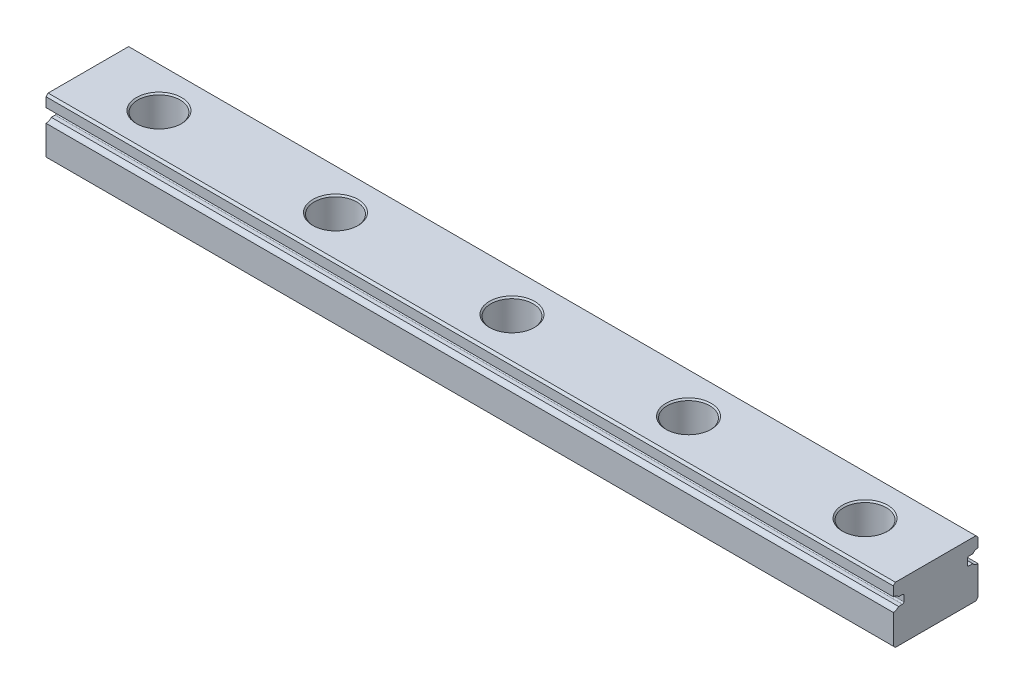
ISO-10303-21;
HEADER;
FILE_DESCRIPTION(('STEP AP214'),'2;1');
FILE_NAME('part.step','',(''),(''),'','','');
FILE_SCHEMA(('AUTOMOTIVE_DESIGN { 1 0 10303 214 1 1 1 1 }'));
ENDSEC;
DATA;
#1=APPLICATION_CONTEXT('core data for automotive mechanical design processes');
#2=APPLICATION_PROTOCOL_DEFINITION('international standard','automotive_design',2000,#1);
#3=PRODUCT_CONTEXT('',#1,'mechanical');
#4=PRODUCT('Part','Part','',(#3));
#5=PRODUCT_RELATED_PRODUCT_CATEGORY('part','',(#4));
#6=PRODUCT_DEFINITION_FORMATION('','',#4);
#7=PRODUCT_DEFINITION_CONTEXT('part definition',#1,'design');
#8=PRODUCT_DEFINITION('design','',#6,#7);
#9=PRODUCT_DEFINITION_SHAPE('','',#8);
#10=(LENGTH_UNIT() NAMED_UNIT(*) SI_UNIT(.MILLI.,.METRE.));
#11=(NAMED_UNIT(*) PLANE_ANGLE_UNIT() SI_UNIT($,.RADIAN.));
#12=(NAMED_UNIT(*) SI_UNIT($,.STERADIAN.) SOLID_ANGLE_UNIT());
#13=UNCERTAINTY_MEASURE_WITH_UNIT(LENGTH_MEASURE(1.E-05),#10,'distance_accuracy_value','');
#14=(GEOMETRIC_REPRESENTATION_CONTEXT(3) GLOBAL_UNCERTAINTY_ASSIGNED_CONTEXT((#13)) GLOBAL_UNIT_ASSIGNED_CONTEXT((#10,
#11,#12)) REPRESENTATION_CONTEXT('',''));
#15=CARTESIAN_POINT('',(0.,0.,0.));
#16=DIRECTION('',(0.,0.,1.));
#17=DIRECTION('',(1.,0.,0.));
#18=AXIS2_PLACEMENT_3D('',#15,#16,#17);
#19=CARTESIAN_POINT('',(120.,8.,-5.7));
#20=DIRECTION('',(0.,-1.,0.));
#21=DIRECTION('',(0.,0.,-1.));
#22=AXIS2_PLACEMENT_3D('',#19,#20,#21);
#23=PLANE('',#22);
#24=DIRECTION('',(0.,0.,1.));
#25=VECTOR('',#24,1.);
#26=CARTESIAN_POINT('',(0.,8.,-5.7));
#27=LINE('',#26,#25);
#28=CARTESIAN_POINT('',(0.,8.,-5.7));
#29=VERTEX_POINT('',#28);
#30=CARTESIAN_POINT('',(0.,8.,5.7));
#31=VERTEX_POINT('',#30);
#32=EDGE_CURVE('E11',#29,#31,#27,.T.);
#33=ORIENTED_EDGE('',*,*,#32,.T.);
#34=DIRECTION('',(-1.,0.,0.));
#35=VECTOR('',#34,1.);
#36=CARTESIAN_POINT('',(120.,8.,5.7));
#37=LINE('',#36,#35);
#38=CARTESIAN_POINT('',(120.,8.,5.7));
#39=VERTEX_POINT('',#38);
#40=EDGE_CURVE('E42',#39,#31,#37,.T.);
#41=ORIENTED_EDGE('',*,*,#40,.F.);
#42=DIRECTION('',(0.,0.,1.));
#43=VECTOR('',#42,1.);
#44=CARTESIAN_POINT('',(120.,8.,-5.7));
#45=LINE('',#44,#43);
#46=CARTESIAN_POINT('',(120.,8.,-5.7));
#47=VERTEX_POINT('',#46);
#48=EDGE_CURVE('E585',#47,#39,#45,.T.);
#49=ORIENTED_EDGE('',*,*,#48,.F.);
#50=DIRECTION('',(-1.,0.,0.));
#51=VECTOR('',#50,1.);
#52=CARTESIAN_POINT('',(120.,8.,-5.7));
#53=LINE('',#52,#51);
#54=EDGE_CURVE('E28',#47,#29,#53,.T.);
#55=ORIENTED_EDGE('',*,*,#54,.T.);
#56=EDGE_LOOP('',(#33,#41,#49,#55));
#57=FACE_BOUND('',#56,.T.);
#58=CARTESIAN_POINT('',(10.,8.,0.));
#59=DIRECTION('',(0.,-1.,0.));
#60=DIRECTION('',(0.,0.,-1.));
#61=AXIS2_PLACEMENT_3D('',#58,#59,#60);
#62=CIRCLE('',#61,3.205);
#63=CARTESIAN_POINT('',(10.,8.,-3.205));
#64=VERTEX_POINT('',#63);
#65=EDGE_CURVE('E402',#64,#64,#62,.T.);
#66=ORIENTED_EDGE('',*,*,#65,.T.);
#67=EDGE_LOOP('',(#66));
#68=FACE_BOUND('',#67,.T.);
#69=CARTESIAN_POINT('',(60.,8.,0.));
#70=DIRECTION('',(0.,-1.,0.));
#71=DIRECTION('',(0.,0.,-1.));
#72=AXIS2_PLACEMENT_3D('',#69,#70,#71);
#73=CIRCLE('',#72,3.205);
#74=CARTESIAN_POINT('',(60.,8.,-3.205));
#75=VERTEX_POINT('',#74);
#76=EDGE_CURVE('E451',#75,#75,#73,.T.);
#77=ORIENTED_EDGE('',*,*,#76,.T.);
#78=EDGE_LOOP('',(#77));
#79=FACE_BOUND('',#78,.T.);
#80=CARTESIAN_POINT('',(85.,8.,0.));
#81=DIRECTION('',(0.,-1.,0.));
#82=DIRECTION('',(0.,0.,-1.));
#83=AXIS2_PLACEMENT_3D('',#80,#81,#82);
#84=CIRCLE('',#83,3.205);
#85=CARTESIAN_POINT('',(85.,8.,-3.205));
#86=VERTEX_POINT('',#85);
#87=EDGE_CURVE('E447',#86,#86,#84,.T.);
#88=ORIENTED_EDGE('',*,*,#87,.T.);
#89=EDGE_LOOP('',(#88));
#90=FACE_BOUND('',#89,.T.);
#91=CARTESIAN_POINT('',(110.,8.,0.));
#92=DIRECTION('',(0.,-1.,0.));
#93=DIRECTION('',(0.,0.,-1.));
#94=AXIS2_PLACEMENT_3D('',#91,#92,#93);
#95=CIRCLE('',#94,3.205);
#96=CARTESIAN_POINT('',(110.,8.,-3.205));
#97=VERTEX_POINT('',#96);
#98=EDGE_CURVE('E435',#97,#97,#95,.T.);
#99=ORIENTED_EDGE('',*,*,#98,.T.);
#100=EDGE_LOOP('',(#99));
#101=FACE_BOUND('',#100,.T.);
#102=CARTESIAN_POINT('',(35.,8.,0.));
#103=DIRECTION('',(0.,-1.,0.));
#104=DIRECTION('',(0.,0.,-1.));
#105=AXIS2_PLACEMENT_3D('',#102,#103,#104);
#106=CIRCLE('',#105,3.205);
#107=CARTESIAN_POINT('',(35.,8.,-3.205));
#108=VERTEX_POINT('',#107);
#109=EDGE_CURVE('E431',#108,#108,#106,.T.);
#110=ORIENTED_EDGE('',*,*,#109,.T.);
#111=EDGE_LOOP('',(#110));
#112=FACE_BOUND('',#111,.T.);
#113=ADVANCED_FACE('F17',(#57,#68,#79,#90,#101,#112),#23,.F.);
#114=CARTESIAN_POINT('',(120.,5.4,6.));
#115=DIRECTION('',(1.,0.,0.));
#116=DIRECTION('',(0.,1.,0.));
#117=AXIS2_PLACEMENT_3D('',#114,#115,#116);
#118=PLANE('',#117);
#119=DIRECTION('',(0.,-0.707106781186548,0.707106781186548));
#120=VECTOR('',#119,1.);
#121=CARTESIAN_POINT('',(120.,8.,5.7));
#122=LINE('',#121,#120);
#123=CARTESIAN_POINT('',(120.,7.7,6.));
#124=VERTEX_POINT('',#123);
#125=EDGE_CURVE('E436',#39,#124,#122,.T.);
#126=ORIENTED_EDGE('',*,*,#125,.T.);
#127=DIRECTION('',(0.,-1.,0.));
#128=VECTOR('',#127,1.);
#129=CARTESIAN_POINT('',(120.,7.7,6.));
#130=LINE('',#129,#128);
#131=CARTESIAN_POINT('',(120.,6.36046863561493,6.));
#132=VERTEX_POINT('',#131);
#133=EDGE_CURVE('E554',#124,#132,#130,.T.);
#134=ORIENTED_EDGE('',*,*,#133,.T.);
#135=CARTESIAN_POINT('',(120.,5.4,6.));
#136=DIRECTION('',(1.,0.,0.));
#137=DIRECTION('',(0.,0.,-1.));
#138=AXIS2_PLACEMENT_3D('',#135,#136,#137);
#139=CIRCLE('',#138,0.9604686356);
#140=CARTESIAN_POINT('',(120.,6.,5.25));
#141=VERTEX_POINT('',#140);
#142=EDGE_CURVE('E708',#141,#132,#139,.T.);
#143=ORIENTED_EDGE('',*,*,#142,.F.);
#144=DIRECTION('',(0.,0.,-1.));
#145=VECTOR('',#144,1.);
#146=CARTESIAN_POINT('',(120.,6.,5.25));
#147=LINE('',#146,#145);
#148=CARTESIAN_POINT('',(120.,6.,4.7));
#149=VERTEX_POINT('',#148);
#150=EDGE_CURVE('E546',#141,#149,#147,.T.);
#151=ORIENTED_EDGE('',*,*,#150,.T.);
#152=CARTESIAN_POINT('',(120.,5.8,4.7));
#153=DIRECTION('',(1.,0.,0.));
#154=DIRECTION('',(0.,0.,-1.));
#155=AXIS2_PLACEMENT_3D('',#152,#153,#154);
#156=CIRCLE('',#155,0.2);
#157=CARTESIAN_POINT('',(120.,5.8,4.5));
#158=VERTEX_POINT('',#157);
#159=EDGE_CURVE('E493',#158,#149,#156,.T.);
#160=ORIENTED_EDGE('',*,*,#159,.F.);
#161=DIRECTION('',(0.,-1.,0.));
#162=VECTOR('',#161,1.);
#163=CARTESIAN_POINT('',(120.,5.8,4.5));
#164=LINE('',#163,#162);
#165=CARTESIAN_POINT('',(120.,5.,4.5));
#166=VERTEX_POINT('',#165);
#167=EDGE_CURVE('E543',#158,#166,#164,.T.);
#168=ORIENTED_EDGE('',*,*,#167,.T.);
#169=CARTESIAN_POINT('',(120.,5.,4.7));
#170=DIRECTION('',(1.,0.,0.));
#171=DIRECTION('',(0.,0.,-1.));
#172=AXIS2_PLACEMENT_3D('',#169,#170,#171);
#173=CIRCLE('',#172,0.2);
#174=CARTESIAN_POINT('',(120.,4.8,4.7));
#175=VERTEX_POINT('',#174);
#176=EDGE_CURVE('E539',#175,#166,#173,.T.);
#177=ORIENTED_EDGE('',*,*,#176,.F.);
#178=DIRECTION('',(0.,0.,1.));
#179=VECTOR('',#178,1.);
#180=CARTESIAN_POINT('',(120.,4.8,4.7));
#181=LINE('',#180,#179);
#182=CARTESIAN_POINT('',(120.,4.8,5.25));
#183=VERTEX_POINT('',#182);
#184=EDGE_CURVE('E531',#175,#183,#181,.T.);
#185=ORIENTED_EDGE('',*,*,#184,.T.);
#186=CARTESIAN_POINT('',(120.,5.4,6.));
#187=DIRECTION('',(1.,0.,0.));
#188=DIRECTION('',(0.,0.,-1.));
#189=AXIS2_PLACEMENT_3D('',#186,#187,#188);
#190=CIRCLE('',#189,0.9604686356);
#191=CARTESIAN_POINT('',(120.,4.43953136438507,6.));
#192=VERTEX_POINT('',#191);
#193=EDGE_CURVE('E408',#192,#183,#190,.T.);
#194=ORIENTED_EDGE('',*,*,#193,.F.);
#195=DIRECTION('',(0.,-1.,0.));
#196=VECTOR('',#195,1.);
#197=CARTESIAN_POINT('',(120.,4.43953136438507,6.));
#198=LINE('',#197,#196);
#199=CARTESIAN_POINT('',(120.,0.3,6.));
#200=VERTEX_POINT('',#199);
#201=EDGE_CURVE('E424',#192,#200,#198,.T.);
#202=ORIENTED_EDGE('',*,*,#201,.T.);
#203=DIRECTION('',(0.,-0.707106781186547,-0.707106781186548));
#204=VECTOR('',#203,1.);
#205=CARTESIAN_POINT('',(120.,0.3,6.));
#206=LINE('',#205,#204);
#207=CARTESIAN_POINT('',(120.,0.,5.7));
#208=VERTEX_POINT('',#207);
#209=EDGE_CURVE('E420',#200,#208,#206,.T.);
#210=ORIENTED_EDGE('',*,*,#209,.T.);
#211=DIRECTION('',(0.,0.,-1.));
#212=VECTOR('',#211,1.);
#213=CARTESIAN_POINT('',(120.,0.,5.7));
#214=LINE('',#213,#212);
#215=CARTESIAN_POINT('',(120.,0.,-5.7));
#216=VERTEX_POINT('',#215);
#217=EDGE_CURVE('E425',#208,#216,#214,.T.);
#218=ORIENTED_EDGE('',*,*,#217,.T.);
#219=DIRECTION('',(0.,0.707106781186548,-0.707106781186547));
#220=VECTOR('',#219,1.);
#221=CARTESIAN_POINT('',(120.,0.,-5.7));
#222=LINE('',#221,#220);
#223=CARTESIAN_POINT('',(120.,0.3,-6.));
#224=VERTEX_POINT('',#223);
#225=EDGE_CURVE('E500',#216,#224,#222,.T.);
#226=ORIENTED_EDGE('',*,*,#225,.T.);
#227=DIRECTION('',(0.,1.,0.));
#228=VECTOR('',#227,1.);
#229=CARTESIAN_POINT('',(120.,0.3,-6.));
#230=LINE('',#229,#228);
#231=CARTESIAN_POINT('',(120.,4.43953136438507,-6.));
#232=VERTEX_POINT('',#231);
#233=EDGE_CURVE('E464',#224,#232,#230,.T.);
#234=ORIENTED_EDGE('',*,*,#233,.T.);
#235=CARTESIAN_POINT('',(120.,5.4,-6.));
#236=DIRECTION('',(1.,0.,0.));
#237=DIRECTION('',(0.,0.,-1.));
#238=AXIS2_PLACEMENT_3D('',#235,#236,#237);
#239=CIRCLE('',#238,0.9604686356);
#240=CARTESIAN_POINT('',(120.,4.8,-5.25));
#241=VERTEX_POINT('',#240);
#242=EDGE_CURVE('E669',#241,#232,#239,.T.);
#243=ORIENTED_EDGE('',*,*,#242,.F.);
#244=DIRECTION('',(0.,0.,1.));
#245=VECTOR('',#244,1.);
#246=CARTESIAN_POINT('',(120.,4.8,-5.25));
#247=LINE('',#246,#245);
#248=CARTESIAN_POINT('',(120.,4.8,-4.7));
#249=VERTEX_POINT('',#248);
#250=EDGE_CURVE('E359',#241,#249,#247,.T.);
#251=ORIENTED_EDGE('',*,*,#250,.T.);
#252=CARTESIAN_POINT('',(120.,5.,-4.7));
#253=DIRECTION('',(1.,0.,0.));
#254=DIRECTION('',(0.,0.,-1.));
#255=AXIS2_PLACEMENT_3D('',#252,#253,#254);
#256=CIRCLE('',#255,0.2);
#257=CARTESIAN_POINT('',(120.,5.,-4.5));
#258=VERTEX_POINT('',#257);
#259=EDGE_CURVE('E351',#258,#249,#256,.T.);
#260=ORIENTED_EDGE('',*,*,#259,.F.);
#261=DIRECTION('',(0.,1.,0.));
#262=VECTOR('',#261,1.);
#263=CARTESIAN_POINT('',(120.,5.,-4.5));
#264=LINE('',#263,#262);
#265=CARTESIAN_POINT('',(120.,5.8,-4.5));
#266=VERTEX_POINT('',#265);
#267=EDGE_CURVE('E356',#258,#266,#264,.T.);
#268=ORIENTED_EDGE('',*,*,#267,.T.);
#269=CARTESIAN_POINT('',(120.,5.8,-4.7));
#270=DIRECTION('',(1.,0.,0.));
#271=DIRECTION('',(0.,0.,-1.));
#272=AXIS2_PLACEMENT_3D('',#269,#270,#271);
#273=CIRCLE('',#272,0.2);
#274=CARTESIAN_POINT('',(120.,6.,-4.7));
#275=VERTEX_POINT('',#274);
#276=EDGE_CURVE('E382',#275,#266,#273,.T.);
#277=ORIENTED_EDGE('',*,*,#276,.F.);
#278=DIRECTION('',(0.,0.,-1.));
#279=VECTOR('',#278,1.);
#280=CARTESIAN_POINT('',(120.,6.,-4.7));
#281=LINE('',#280,#279);
#282=CARTESIAN_POINT('',(120.,6.,-5.25));
#283=VERTEX_POINT('',#282);
#284=EDGE_CURVE('E375',#275,#283,#281,.T.);
#285=ORIENTED_EDGE('',*,*,#284,.T.);
#286=CARTESIAN_POINT('',(120.,5.4,-6.));
#287=DIRECTION('',(1.,0.,0.));
#288=DIRECTION('',(0.,0.,-1.));
#289=AXIS2_PLACEMENT_3D('',#286,#287,#288);
#290=CIRCLE('',#289,0.9604686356);
#291=CARTESIAN_POINT('',(120.,6.36046863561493,-6.));
#292=VERTEX_POINT('',#291);
#293=EDGE_CURVE('E881',#292,#283,#290,.T.);
#294=ORIENTED_EDGE('',*,*,#293,.F.);
#295=DIRECTION('',(0.,1.,0.));
#296=VECTOR('',#295,1.);
#297=CARTESIAN_POINT('',(120.,6.36046863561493,-6.));
#298=LINE('',#297,#296);
#299=CARTESIAN_POINT('',(120.,7.7,-6.));
#300=VERTEX_POINT('',#299);
#301=EDGE_CURVE('E527',#292,#300,#298,.T.);
#302=ORIENTED_EDGE('',*,*,#301,.T.);
#303=DIRECTION('',(0.,0.707106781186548,0.707106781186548));
#304=VECTOR('',#303,1.);
#305=CARTESIAN_POINT('',(120.,7.7,-6.));
#306=LINE('',#305,#304);
#307=EDGE_CURVE('E594',#300,#47,#306,.T.);
#308=ORIENTED_EDGE('',*,*,#307,.T.);
#309=ORIENTED_EDGE('',*,*,#48,.T.);
#310=EDGE_LOOP('',(#126,#134,#143,#151,#160,#168,#177,#185,#194,#202,#210,#218,#226,#234,#243,
#251,#260,#268,#277,#285,#294,#302,#308,#309));
#311=FACE_BOUND('',#310,.T.);
#312=ADVANCED_FACE('F354',(#311),#118,.T.);
#313=CARTESIAN_POINT('',(120.,7.7,-6.));
#314=DIRECTION('',(0.,-0.707106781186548,0.707106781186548));
#315=DIRECTION('',(-1.,0.,0.));
#316=AXIS2_PLACEMENT_3D('',#313,#314,#315);
#317=PLANE('',#316);
#318=DIRECTION('',(0.,0.707106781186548,0.707106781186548));
#319=VECTOR('',#318,1.);
#320=CARTESIAN_POINT('',(0.,7.7,-6.));
#321=LINE('',#320,#319);
#322=CARTESIAN_POINT('',(0.,7.7,-6.));
#323=VERTEX_POINT('',#322);
#324=EDGE_CURVE('E581',#323,#29,#321,.T.);
#325=ORIENTED_EDGE('',*,*,#324,.T.);
#326=ORIENTED_EDGE('',*,*,#54,.F.);
#327=ORIENTED_EDGE('',*,*,#307,.F.);
#328=DIRECTION('',(-1.,0.,0.));
#329=VECTOR('',#328,1.);
#330=CARTESIAN_POINT('',(120.,7.7,-6.));
#331=LINE('',#330,#329);
#332=EDGE_CURVE('E586',#300,#323,#331,.T.);
#333=ORIENTED_EDGE('',*,*,#332,.T.);
#334=EDGE_LOOP('',(#325,#326,#327,#333));
#335=FACE_BOUND('',#334,.T.);
#336=ADVANCED_FACE('F789',(#335),#317,.F.);
#337=CARTESIAN_POINT('',(120.,8.,5.7));
#338=DIRECTION('',(0.,-0.707106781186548,-0.707106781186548));
#339=DIRECTION('',(0.,-0.707106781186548,0.707106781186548));
#340=AXIS2_PLACEMENT_3D('',#337,#338,#339);
#341=PLANE('',#340);
#342=DIRECTION('',(0.,-0.707106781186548,0.707106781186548));
#343=VECTOR('',#342,1.);
#344=CARTESIAN_POINT('',(0.,8.,5.7));
#345=LINE('',#344,#343);
#346=CARTESIAN_POINT('',(0.,7.7,6.));
#347=VERTEX_POINT('',#346);
#348=EDGE_CURVE('E665',#31,#347,#345,.T.);
#349=ORIENTED_EDGE('',*,*,#348,.T.);
#350=DIRECTION('',(-1.,0.,0.));
#351=VECTOR('',#350,1.);
#352=CARTESIAN_POINT('',(120.,7.7,6.));
#353=LINE('',#352,#351);
#354=EDGE_CURVE('E215',#124,#347,#353,.T.);
#355=ORIENTED_EDGE('',*,*,#354,.F.);
#356=ORIENTED_EDGE('',*,*,#125,.F.);
#357=ORIENTED_EDGE('',*,*,#40,.T.);
#358=EDGE_LOOP('',(#349,#355,#356,#357));
#359=FACE_BOUND('',#358,.T.);
#360=ADVANCED_FACE('F899',(#359),#341,.F.);
#361=CARTESIAN_POINT('',(120.,7.7,6.));
#362=DIRECTION('',(0.,0.,-1.));
#363=DIRECTION('',(0.,-1.,0.));
#364=AXIS2_PLACEMENT_3D('',#361,#362,#363);
#365=PLANE('',#364);
#366=DIRECTION('',(0.,-1.,0.));
#367=VECTOR('',#366,1.);
#368=CARTESIAN_POINT('',(0.,7.7,6.));
#369=LINE('',#368,#367);
#370=CARTESIAN_POINT('',(0.,6.36046863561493,6.));
#371=VERTEX_POINT('',#370);
#372=EDGE_CURVE('E575',#347,#371,#369,.T.);
#373=ORIENTED_EDGE('',*,*,#372,.T.);
#374=DIRECTION('',(-1.,0.,0.));
#375=VECTOR('',#374,1.);
#376=CARTESIAN_POINT('',(120.,6.36046863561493,6.));
#377=LINE('',#376,#375);
#378=EDGE_CURVE('E222',#132,#371,#377,.T.);
#379=ORIENTED_EDGE('',*,*,#378,.F.);
#380=ORIENTED_EDGE('',*,*,#133,.F.);
#381=ORIENTED_EDGE('',*,*,#354,.T.);
#382=EDGE_LOOP('',(#373,#379,#380,#381));
#383=FACE_BOUND('',#382,.T.);
#384=ADVANCED_FACE('F868',(#383),#365,.F.);
#385=CARTESIAN_POINT('',(120.,5.4,6.));
#386=DIRECTION('',(1.,0.,0.));
#387=DIRECTION('',(0.,0.,1.));
#388=AXIS2_PLACEMENT_3D('',#385,#386,#387);
#389=CYLINDRICAL_SURFACE('',#388,0.9604686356);
#390=CARTESIAN_POINT('',(0.,5.4,6.));
#391=DIRECTION('',(1.,0.,0.));
#392=DIRECTION('',(0.,0.,-1.));
#393=AXIS2_PLACEMENT_3D('',#390,#391,#392);
#394=CIRCLE('',#393,0.9604686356);
#395=CARTESIAN_POINT('',(0.,6.,5.25));
#396=VERTEX_POINT('',#395);
#397=EDGE_CURVE('E230',#396,#371,#394,.T.);
#398=ORIENTED_EDGE('',*,*,#397,.F.);
#399=DIRECTION('',(-1.,0.,0.));
#400=VECTOR('',#399,1.);
#401=CARTESIAN_POINT('',(120.,6.,5.25));
#402=LINE('',#401,#400);
#403=EDGE_CURVE('E574',#141,#396,#402,.T.);
#404=ORIENTED_EDGE('',*,*,#403,.F.);
#405=ORIENTED_EDGE('',*,*,#142,.T.);
#406=ORIENTED_EDGE('',*,*,#378,.T.);
#407=EDGE_LOOP('',(#398,#404,#405,#406));
#408=FACE_BOUND('',#407,.T.);
#409=ADVANCED_FACE('F831',(#408),#389,.F.);
#410=CARTESIAN_POINT('',(120.,6.,5.25));
#411=DIRECTION('',(0.,1.,0.));
#412=DIRECTION('',(1.,0.,0.));
#413=AXIS2_PLACEMENT_3D('',#410,#411,#412);
#414=PLANE('',#413);
#415=DIRECTION('',(0.,0.,-1.));
#416=VECTOR('',#415,1.);
#417=CARTESIAN_POINT('',(0.,6.,5.25));
#418=LINE('',#417,#416);
#419=CARTESIAN_POINT('',(0.,6.,4.7));
#420=VERTEX_POINT('',#419);
#421=EDGE_CURVE('E570',#396,#420,#418,.T.);
#422=ORIENTED_EDGE('',*,*,#421,.T.);
#423=DIRECTION('',(-1.,0.,0.));
#424=VECTOR('',#423,1.);
#425=CARTESIAN_POINT('',(120.,6.,4.7));
#426=LINE('',#425,#424);
#427=EDGE_CURVE('E473',#149,#420,#426,.T.);
#428=ORIENTED_EDGE('',*,*,#427,.F.);
#429=ORIENTED_EDGE('',*,*,#150,.F.);
#430=ORIENTED_EDGE('',*,*,#403,.T.);
#431=EDGE_LOOP('',(#422,#428,#429,#430));
#432=FACE_BOUND('',#431,.T.);
#433=ADVANCED_FACE('F827',(#432),#414,.F.);
#434=CARTESIAN_POINT('',(120.,5.8,4.7));
#435=DIRECTION('',(1.,0.,0.));
#436=DIRECTION('',(0.,0.,1.));
#437=AXIS2_PLACEMENT_3D('',#434,#435,#436);
#438=CYLINDRICAL_SURFACE('',#437,0.2);
#439=CARTESIAN_POINT('',(0.,5.8,4.7));
#440=DIRECTION('',(1.,0.,0.));
#441=DIRECTION('',(0.,0.,-1.));
#442=AXIS2_PLACEMENT_3D('',#439,#440,#441);
#443=CIRCLE('',#442,0.2);
#444=CARTESIAN_POINT('',(0.,5.8,4.5));
#445=VERTEX_POINT('',#444);
#446=EDGE_CURVE('E477',#445,#420,#443,.T.);
#447=ORIENTED_EDGE('',*,*,#446,.F.);
#448=DIRECTION('',(-1.,0.,0.));
#449=VECTOR('',#448,1.);
#450=CARTESIAN_POINT('',(120.,5.8,4.5));
#451=LINE('',#450,#449);
#452=EDGE_CURVE('E474',#158,#445,#451,.T.);
#453=ORIENTED_EDGE('',*,*,#452,.F.);
#454=ORIENTED_EDGE('',*,*,#159,.T.);
#455=ORIENTED_EDGE('',*,*,#427,.T.);
#456=EDGE_LOOP('',(#447,#453,#454,#455));
#457=FACE_BOUND('',#456,.T.);
#458=ADVANCED_FACE('F830',(#457),#438,.F.);
#459=CARTESIAN_POINT('',(120.,5.8,4.5));
#460=DIRECTION('',(0.,0.,-1.));
#461=DIRECTION('',(0.,-1.,0.));
#462=AXIS2_PLACEMENT_3D('',#459,#460,#461);
#463=PLANE('',#462);
#464=DIRECTION('',(0.,-1.,0.));
#465=VECTOR('',#464,1.);
#466=CARTESIAN_POINT('',(0.,5.8,4.5));
#467=LINE('',#466,#465);
#468=CARTESIAN_POINT('',(0.,5.,4.5));
#469=VERTEX_POINT('',#468);
#470=EDGE_CURVE('E469',#445,#469,#467,.T.);
#471=ORIENTED_EDGE('',*,*,#470,.T.);
#472=DIRECTION('',(-1.,0.,0.));
#473=VECTOR('',#472,1.);
#474=CARTESIAN_POINT('',(120.,5.,4.5));
#475=LINE('',#474,#473);
#476=EDGE_CURVE('E619',#166,#469,#475,.T.);
#477=ORIENTED_EDGE('',*,*,#476,.F.);
#478=ORIENTED_EDGE('',*,*,#167,.F.);
#479=ORIENTED_EDGE('',*,*,#452,.T.);
#480=EDGE_LOOP('',(#471,#477,#478,#479));
#481=FACE_BOUND('',#480,.T.);
#482=ADVANCED_FACE('F849',(#481),#463,.F.);
#483=CARTESIAN_POINT('',(120.,5.,4.7));
#484=DIRECTION('',(1.,0.,0.));
#485=DIRECTION('',(0.,0.,1.));
#486=AXIS2_PLACEMENT_3D('',#483,#484,#485);
#487=CYLINDRICAL_SURFACE('',#486,0.2);
#488=CARTESIAN_POINT('',(0.,5.,4.7));
#489=DIRECTION('',(1.,0.,0.));
#490=DIRECTION('',(0.,0.,-1.));
#491=AXIS2_PLACEMENT_3D('',#488,#489,#490);
#492=CIRCLE('',#491,0.2);
#493=CARTESIAN_POINT('',(0.,4.8,4.7));
#494=VERTEX_POINT('',#493);
#495=EDGE_CURVE('E565',#494,#469,#492,.T.);
#496=ORIENTED_EDGE('',*,*,#495,.F.);
#497=DIRECTION('',(-1.,0.,0.));
#498=VECTOR('',#497,1.);
#499=CARTESIAN_POINT('',(120.,4.8,4.7));
#500=LINE('',#499,#498);
#501=EDGE_CURVE('E403',#175,#494,#500,.T.);
#502=ORIENTED_EDGE('',*,*,#501,.F.);
#503=ORIENTED_EDGE('',*,*,#176,.T.);
#504=ORIENTED_EDGE('',*,*,#476,.T.);
#505=EDGE_LOOP('',(#496,#502,#503,#504));
#506=FACE_BOUND('',#505,.T.);
#507=ADVANCED_FACE('F777',(#506),#487,.F.);
#508=CARTESIAN_POINT('',(120.,4.8,4.7));
#509=DIRECTION('',(0.,-1.,0.));
#510=DIRECTION('',(0.,0.,-1.));
#511=AXIS2_PLACEMENT_3D('',#508,#509,#510);
#512=PLANE('',#511);
#513=DIRECTION('',(0.,0.,1.));
#514=VECTOR('',#513,1.);
#515=CARTESIAN_POINT('',(0.,4.8,4.7));
#516=LINE('',#515,#514);
#517=CARTESIAN_POINT('',(0.,4.8,5.25));
#518=VERTEX_POINT('',#517);
#519=EDGE_CURVE('E407',#494,#518,#516,.T.);
#520=ORIENTED_EDGE('',*,*,#519,.T.);
#521=DIRECTION('',(-1.,0.,0.));
#522=VECTOR('',#521,1.);
#523=CARTESIAN_POINT('',(120.,4.8,5.25));
#524=LINE('',#523,#522);
#525=EDGE_CURVE('E416',#183,#518,#524,.T.);
#526=ORIENTED_EDGE('',*,*,#525,.F.);
#527=ORIENTED_EDGE('',*,*,#184,.F.);
#528=ORIENTED_EDGE('',*,*,#501,.T.);
#529=EDGE_LOOP('',(#520,#526,#527,#528));
#530=FACE_BOUND('',#529,.T.);
#531=ADVANCED_FACE('F768',(#530),#512,.F.);
#532=CARTESIAN_POINT('',(120.,5.4,6.));
#533=DIRECTION('',(1.,0.,0.));
#534=DIRECTION('',(0.,0.,1.));
#535=AXIS2_PLACEMENT_3D('',#532,#533,#534);
#536=CYLINDRICAL_SURFACE('',#535,0.9604686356);
#537=CARTESIAN_POINT('',(0.,5.4,6.));
#538=DIRECTION('',(1.,0.,0.));
#539=DIRECTION('',(0.,0.,-1.));
#540=AXIS2_PLACEMENT_3D('',#537,#538,#539);
#541=CIRCLE('',#540,0.9604686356);
#542=CARTESIAN_POINT('',(0.,4.43953136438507,6.));
#543=VERTEX_POINT('',#542);
#544=EDGE_CURVE('E569',#543,#518,#541,.T.);
#545=ORIENTED_EDGE('',*,*,#544,.F.);
#546=DIRECTION('',(-1.,0.,0.));
#547=VECTOR('',#546,1.);
#548=CARTESIAN_POINT('',(120.,4.43953136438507,6.));
#549=LINE('',#548,#547);
#550=EDGE_CURVE('E440',#192,#543,#549,.T.);
#551=ORIENTED_EDGE('',*,*,#550,.F.);
#552=ORIENTED_EDGE('',*,*,#193,.T.);
#553=ORIENTED_EDGE('',*,*,#525,.T.);
#554=EDGE_LOOP('',(#545,#551,#552,#553));
#555=FACE_BOUND('',#554,.T.);
#556=ADVANCED_FACE('F766',(#555),#536,.F.);
#557=CARTESIAN_POINT('',(120.,4.43953136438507,6.));
#558=DIRECTION('',(0.,0.,-1.));
#559=DIRECTION('',(0.,-1.,0.));
#560=AXIS2_PLACEMENT_3D('',#557,#558,#559);
#561=PLANE('',#560);
#562=DIRECTION('',(0.,-1.,0.));
#563=VECTOR('',#562,1.);
#564=CARTESIAN_POINT('',(0.,4.43953136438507,6.));
#565=LINE('',#564,#563);
#566=CARTESIAN_POINT('',(0.,0.3,6.));
#567=VERTEX_POINT('',#566);
#568=EDGE_CURVE('E419',#543,#567,#565,.T.);
#569=ORIENTED_EDGE('',*,*,#568,.T.);
#570=DIRECTION('',(-1.,0.,0.));
#571=VECTOR('',#570,1.);
#572=CARTESIAN_POINT('',(120.,0.3,6.));
#573=LINE('',#572,#571);
#574=EDGE_CURVE('E535',#200,#567,#573,.T.);
#575=ORIENTED_EDGE('',*,*,#574,.F.);
#576=ORIENTED_EDGE('',*,*,#201,.F.);
#577=ORIENTED_EDGE('',*,*,#550,.T.);
#578=EDGE_LOOP('',(#569,#575,#576,#577));
#579=FACE_BOUND('',#578,.T.);
#580=ADVANCED_FACE('F743',(#579),#561,.F.);
#581=CARTESIAN_POINT('',(120.,0.3,6.));
#582=DIRECTION('',(0.,0.707106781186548,-0.707106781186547));
#583=DIRECTION('',(-1.,0.,0.));
#584=AXIS2_PLACEMENT_3D('',#581,#582,#583);
#585=PLANE('',#584);
#586=DIRECTION('',(0.,-0.707106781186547,-0.707106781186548));
#587=VECTOR('',#586,1.);
#588=CARTESIAN_POINT('',(0.,0.3,6.));
#589=LINE('',#588,#587);
#590=CARTESIAN_POINT('',(0.,0.,5.7));
#591=VERTEX_POINT('',#590);
#592=EDGE_CURVE('E514',#567,#591,#589,.T.);
#593=ORIENTED_EDGE('',*,*,#592,.T.);
#594=DIRECTION('',(-1.,0.,0.));
#595=VECTOR('',#594,1.);
#596=CARTESIAN_POINT('',(120.,0.,5.7));
#597=LINE('',#596,#595);
#598=EDGE_CURVE('E457',#208,#591,#597,.T.);
#599=ORIENTED_EDGE('',*,*,#598,.F.);
#600=ORIENTED_EDGE('',*,*,#209,.F.);
#601=ORIENTED_EDGE('',*,*,#574,.T.);
#602=EDGE_LOOP('',(#593,#599,#600,#601));
#603=FACE_BOUND('',#602,.T.);
#604=ADVANCED_FACE('F739',(#603),#585,.F.);
#605=CARTESIAN_POINT('',(120.,0.,5.7));
#606=DIRECTION('',(0.,1.,0.));
#607=DIRECTION('',(1.,0.,0.));
#608=AXIS2_PLACEMENT_3D('',#605,#606,#607);
#609=PLANE('',#608);
#610=DIRECTION('',(0.,0.,-1.));
#611=VECTOR('',#610,1.);
#612=CARTESIAN_POINT('',(0.,0.,5.7));
#613=LINE('',#612,#611);
#614=CARTESIAN_POINT('',(0.,0.,-5.7));
#615=VERTEX_POINT('',#614);
#616=EDGE_CURVE('E460',#591,#615,#613,.T.);
#617=ORIENTED_EDGE('',*,*,#616,.T.);
#618=DIRECTION('',(-1.,0.,0.));
#619=VECTOR('',#618,1.);
#620=CARTESIAN_POINT('',(120.,0.,-5.7));
#621=LINE('',#620,#619);
#622=EDGE_CURVE('E611',#216,#615,#621,.T.);
#623=ORIENTED_EDGE('',*,*,#622,.F.);
#624=ORIENTED_EDGE('',*,*,#217,.F.);
#625=ORIENTED_EDGE('',*,*,#598,.T.);
#626=EDGE_LOOP('',(#617,#623,#624,#625));
#627=FACE_BOUND('',#626,.T.);
#628=CARTESIAN_POINT('',(10.,0.,0.));
#629=DIRECTION('',(0.,-1.,0.));
#630=DIRECTION('',(0.,0.,-1.));
#631=AXIS2_PLACEMENT_3D('',#628,#629,#630);
#632=CIRCLE('',#631,1.955);
#633=CARTESIAN_POINT('',(10.,0.,-1.955));
#634=VERTEX_POINT('',#633);
#635=EDGE_CURVE('E523',#634,#634,#632,.T.);
#636=ORIENTED_EDGE('',*,*,#635,.F.);
#637=EDGE_LOOP('',(#636));
#638=FACE_BOUND('',#637,.T.);
#639=CARTESIAN_POINT('',(60.,0.,0.));
#640=DIRECTION('',(0.,-1.,0.));
#641=DIRECTION('',(0.,0.,-1.));
#642=AXIS2_PLACEMENT_3D('',#639,#640,#641);
#643=CIRCLE('',#642,1.955);
#644=CARTESIAN_POINT('',(60.,0.,-1.955));
#645=VERTEX_POINT('',#644);
#646=EDGE_CURVE('E502',#645,#645,#643,.T.);
#647=ORIENTED_EDGE('',*,*,#646,.F.);
#648=EDGE_LOOP('',(#647));
#649=FACE_BOUND('',#648,.T.);
#650=CARTESIAN_POINT('',(85.,0.,0.));
#651=DIRECTION('',(0.,-1.,0.));
#652=DIRECTION('',(0.,0.,-1.));
#653=AXIS2_PLACEMENT_3D('',#650,#651,#652);
#654=CIRCLE('',#653,1.955);
#655=CARTESIAN_POINT('',(85.,0.,-1.955));
#656=VERTEX_POINT('',#655);
#657=EDGE_CURVE('E490',#656,#656,#654,.T.);
#658=ORIENTED_EDGE('',*,*,#657,.F.);
#659=EDGE_LOOP('',(#658));
#660=FACE_BOUND('',#659,.T.);
#661=CARTESIAN_POINT('',(110.,0.,0.));
#662=DIRECTION('',(0.,-1.,0.));
#663=DIRECTION('',(0.,0.,-1.));
#664=AXIS2_PLACEMENT_3D('',#661,#662,#663);
#665=CIRCLE('',#664,1.955);
#666=CARTESIAN_POINT('',(110.,0.,-1.955));
#667=VERTEX_POINT('',#666);
#668=EDGE_CURVE('E483',#667,#667,#665,.T.);
#669=ORIENTED_EDGE('',*,*,#668,.F.);
#670=EDGE_LOOP('',(#669));
#671=FACE_BOUND('',#670,.T.);
#672=CARTESIAN_POINT('',(35.,0.,0.));
#673=DIRECTION('',(0.,-1.,0.));
#674=DIRECTION('',(0.,0.,-1.));
#675=AXIS2_PLACEMENT_3D('',#672,#673,#674);
#676=CIRCLE('',#675,1.955);
#677=CARTESIAN_POINT('',(35.,0.,-1.955));
#678=VERTEX_POINT('',#677);
#679=EDGE_CURVE('E564',#678,#678,#676,.T.);
#680=ORIENTED_EDGE('',*,*,#679,.F.);
#681=EDGE_LOOP('',(#680));
#682=FACE_BOUND('',#681,.T.);
#683=ADVANCED_FACE('F735',(#627,#638,#649,#660,#671,#682),#609,.F.);
#684=CARTESIAN_POINT('',(120.,0.,-5.7));
#685=DIRECTION('',(0.,0.707106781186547,0.707106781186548));
#686=DIRECTION('',(1.,0.,0.));
#687=AXIS2_PLACEMENT_3D('',#684,#685,#686);
#688=PLANE('',#687);
#689=DIRECTION('',(0.,0.707106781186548,-0.707106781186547));
#690=VECTOR('',#689,1.);
#691=CARTESIAN_POINT('',(0.,0.,-5.7));
#692=LINE('',#691,#690);
#693=CARTESIAN_POINT('',(0.,0.3,-6.));
#694=VERTEX_POINT('',#693);
#695=EDGE_CURVE('E461',#615,#694,#692,.T.);
#696=ORIENTED_EDGE('',*,*,#695,.T.);
#697=DIRECTION('',(-1.,0.,0.));
#698=VECTOR('',#697,1.);
#699=CARTESIAN_POINT('',(120.,0.3,-6.));
#700=LINE('',#699,#698);
#701=EDGE_CURVE('E643',#224,#694,#700,.T.);
#702=ORIENTED_EDGE('',*,*,#701,.F.);
#703=ORIENTED_EDGE('',*,*,#225,.F.);
#704=ORIENTED_EDGE('',*,*,#622,.T.);
#705=EDGE_LOOP('',(#696,#702,#703,#704));
#706=FACE_BOUND('',#705,.T.);
#707=ADVANCED_FACE('F729',(#706),#688,.F.);
#708=CARTESIAN_POINT('',(120.,0.3,-6.));
#709=DIRECTION('',(0.,0.,1.));
#710=DIRECTION('',(1.,0.,0.));
#711=AXIS2_PLACEMENT_3D('',#708,#709,#710);
#712=PLANE('',#711);
#713=DIRECTION('',(0.,1.,0.));
#714=VECTOR('',#713,1.);
#715=CARTESIAN_POINT('',(0.,0.3,-6.));
#716=LINE('',#715,#714);
#717=CARTESIAN_POINT('',(0.,4.43953136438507,-6.));
#718=VERTEX_POINT('',#717);
#719=EDGE_CURVE('E613',#694,#718,#716,.T.);
#720=ORIENTED_EDGE('',*,*,#719,.T.);
#721=DIRECTION('',(-1.,0.,0.));
#722=VECTOR('',#721,1.);
#723=CARTESIAN_POINT('',(120.,4.43953136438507,-6.));
#724=LINE('',#723,#722);
#725=EDGE_CURVE('E393',#232,#718,#724,.T.);
#726=ORIENTED_EDGE('',*,*,#725,.F.);
#727=ORIENTED_EDGE('',*,*,#233,.F.);
#728=ORIENTED_EDGE('',*,*,#701,.T.);
#729=EDGE_LOOP('',(#720,#726,#727,#728));
#730=FACE_BOUND('',#729,.T.);
#731=ADVANCED_FACE('F726',(#730),#712,.F.);
#732=CARTESIAN_POINT('',(120.,5.4,-6.));
#733=DIRECTION('',(1.,0.,0.));
#734=DIRECTION('',(0.,0.,1.));
#735=AXIS2_PLACEMENT_3D('',#732,#733,#734);
#736=CYLINDRICAL_SURFACE('',#735,0.9604686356);
#737=CARTESIAN_POINT('',(0.,5.4,-6.));
#738=DIRECTION('',(1.,0.,0.));
#739=DIRECTION('',(0.,0.,-1.));
#740=AXIS2_PLACEMENT_3D('',#737,#738,#739);
#741=CIRCLE('',#740,0.9604686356);
#742=CARTESIAN_POINT('',(0.,4.8,-5.25));
#743=VERTEX_POINT('',#742);
#744=EDGE_CURVE('E415',#743,#718,#741,.T.);
#745=ORIENTED_EDGE('',*,*,#744,.F.);
#746=DIRECTION('',(-1.,0.,0.));
#747=VECTOR('',#746,1.);
#748=CARTESIAN_POINT('',(120.,4.8,-5.25));
#749=LINE('',#748,#747);
#750=EDGE_CURVE('E364',#241,#743,#749,.T.);
#751=ORIENTED_EDGE('',*,*,#750,.F.);
#752=ORIENTED_EDGE('',*,*,#242,.T.);
#753=ORIENTED_EDGE('',*,*,#725,.T.);
#754=EDGE_LOOP('',(#745,#751,#752,#753));
#755=FACE_BOUND('',#754,.T.);
#756=ADVANCED_FACE('F723',(#755),#736,.F.);
#757=CARTESIAN_POINT('',(120.,4.8,-5.25));
#758=DIRECTION('',(0.,-1.,0.));
#759=DIRECTION('',(0.,0.,-1.));
#760=AXIS2_PLACEMENT_3D('',#757,#758,#759);
#761=PLANE('',#760);
#762=DIRECTION('',(0.,0.,1.));
#763=VECTOR('',#762,1.);
#764=CARTESIAN_POINT('',(0.,4.8,-5.25));
#765=LINE('',#764,#763);
#766=CARTESIAN_POINT('',(0.,4.8,-4.7));
#767=VERTEX_POINT('',#766);
#768=EDGE_CURVE('E674',#743,#767,#765,.T.);
#769=ORIENTED_EDGE('',*,*,#768,.T.);
#770=DIRECTION('',(-1.,0.,0.));
#771=VECTOR('',#770,1.);
#772=CARTESIAN_POINT('',(120.,4.8,-4.7));
#773=LINE('',#772,#771);
#774=EDGE_CURVE('E365',#249,#767,#773,.T.);
#775=ORIENTED_EDGE('',*,*,#774,.F.);
#776=ORIENTED_EDGE('',*,*,#250,.F.);
#777=ORIENTED_EDGE('',*,*,#750,.T.);
#778=EDGE_LOOP('',(#769,#775,#776,#777));
#779=FACE_BOUND('',#778,.T.);
#780=ADVANCED_FACE('F926',(#779),#761,.F.);
#781=CARTESIAN_POINT('',(120.,5.,-4.7));
#782=DIRECTION('',(1.,0.,0.));
#783=DIRECTION('',(0.,0.,1.));
#784=AXIS2_PLACEMENT_3D('',#781,#782,#783);
#785=CYLINDRICAL_SURFACE('',#784,0.2);
#786=CARTESIAN_POINT('',(0.,5.,-4.7));
#787=DIRECTION('',(1.,0.,0.));
#788=DIRECTION('',(0.,0.,-1.));
#789=AXIS2_PLACEMENT_3D('',#786,#787,#788);
#790=CIRCLE('',#789,0.2);
#791=CARTESIAN_POINT('',(0.,5.,-4.5));
#792=VERTEX_POINT('',#791);
#793=EDGE_CURVE('E379',#792,#767,#790,.T.);
#794=ORIENTED_EDGE('',*,*,#793,.F.);
#795=DIRECTION('',(-1.,0.,0.));
#796=VECTOR('',#795,1.);
#797=CARTESIAN_POINT('',(120.,5.,-4.5));
#798=LINE('',#797,#796);
#799=EDGE_CURVE('E371',#258,#792,#798,.T.);
#800=ORIENTED_EDGE('',*,*,#799,.F.);
#801=ORIENTED_EDGE('',*,*,#259,.T.);
#802=ORIENTED_EDGE('',*,*,#774,.T.);
#803=EDGE_LOOP('',(#794,#800,#801,#802));
#804=FACE_BOUND('',#803,.T.);
#805=ADVANCED_FACE('F377',(#804),#785,.F.);
#806=CARTESIAN_POINT('',(120.,5.,-4.5));
#807=DIRECTION('',(0.,0.,1.));
#808=DIRECTION('',(1.,0.,0.));
#809=AXIS2_PLACEMENT_3D('',#806,#807,#808);
#810=PLANE('',#809);
#811=DIRECTION('',(0.,1.,0.));
#812=VECTOR('',#811,1.);
#813=CARTESIAN_POINT('',(0.,5.,-4.5));
#814=LINE('',#813,#812);
#815=CARTESIAN_POINT('',(0.,5.8,-4.5));
#816=VERTEX_POINT('',#815);
#817=EDGE_CURVE('E381',#792,#816,#814,.T.);
#818=ORIENTED_EDGE('',*,*,#817,.T.);
#819=DIRECTION('',(-1.,0.,0.));
#820=VECTOR('',#819,1.);
#821=CARTESIAN_POINT('',(120.,5.8,-4.5));
#822=LINE('',#821,#820);
#823=EDGE_CURVE('E373',#266,#816,#822,.T.);
#824=ORIENTED_EDGE('',*,*,#823,.F.);
#825=ORIENTED_EDGE('',*,*,#267,.F.);
#826=ORIENTED_EDGE('',*,*,#799,.T.);
#827=EDGE_LOOP('',(#818,#824,#825,#826));
#828=FACE_BOUND('',#827,.T.);
#829=ADVANCED_FACE('F370',(#828),#810,.F.);
#830=CARTESIAN_POINT('',(120.,5.8,-4.7));
#831=DIRECTION('',(1.,0.,0.));
#832=DIRECTION('',(0.,0.,1.));
#833=AXIS2_PLACEMENT_3D('',#830,#831,#832);
#834=CYLINDRICAL_SURFACE('',#833,0.2);
#835=CARTESIAN_POINT('',(0.,5.8,-4.7));
#836=DIRECTION('',(1.,0.,0.));
#837=DIRECTION('',(0.,0.,-1.));
#838=AXIS2_PLACEMENT_3D('',#835,#836,#837);
#839=CIRCLE('',#838,0.2);
#840=CARTESIAN_POINT('',(0.,6.,-4.7));
#841=VERTEX_POINT('',#840);
#842=EDGE_CURVE('E414',#841,#816,#839,.T.);
#843=ORIENTED_EDGE('',*,*,#842,.F.);
#844=DIRECTION('',(-1.,0.,0.));
#845=VECTOR('',#844,1.);
#846=CARTESIAN_POINT('',(120.,6.,-4.7));
#847=LINE('',#846,#845);
#848=EDGE_CURVE('E510',#275,#841,#847,.T.);
#849=ORIENTED_EDGE('',*,*,#848,.F.);
#850=ORIENTED_EDGE('',*,*,#276,.T.);
#851=ORIENTED_EDGE('',*,*,#823,.T.);
#852=EDGE_LOOP('',(#843,#849,#850,#851));
#853=FACE_BOUND('',#852,.T.);
#854=ADVANCED_FACE('F822',(#853),#834,.F.);
#855=CARTESIAN_POINT('',(120.,6.,-4.7));
#856=DIRECTION('',(0.,1.,0.));
#857=DIRECTION('',(1.,0.,0.));
#858=AXIS2_PLACEMENT_3D('',#855,#856,#857);
#859=PLANE('',#858);
#860=DIRECTION('',(0.,0.,-1.));
#861=VECTOR('',#860,1.);
#862=CARTESIAN_POINT('',(0.,6.,-4.7));
#863=LINE('',#862,#861);
#864=CARTESIAN_POINT('',(0.,6.,-5.25));
#865=VERTEX_POINT('',#864);
#866=EDGE_CURVE('E411',#841,#865,#863,.T.);
#867=ORIENTED_EDGE('',*,*,#866,.T.);
#868=DIRECTION('',(-1.,0.,0.));
#869=VECTOR('',#868,1.);
#870=CARTESIAN_POINT('',(120.,6.,-5.25));
#871=LINE('',#870,#869);
#872=EDGE_CURVE('E21',#283,#865,#871,.T.);
#873=ORIENTED_EDGE('',*,*,#872,.F.);
#874=ORIENTED_EDGE('',*,*,#284,.F.);
#875=ORIENTED_EDGE('',*,*,#848,.T.);
#876=EDGE_LOOP('',(#867,#873,#874,#875));
#877=FACE_BOUND('',#876,.T.);
#878=ADVANCED_FACE('F940',(#877),#859,.F.);
#879=CARTESIAN_POINT('',(120.,5.4,-6.));
#880=DIRECTION('',(1.,0.,0.));
#881=DIRECTION('',(0.,0.,1.));
#882=AXIS2_PLACEMENT_3D('',#879,#880,#881);
#883=CYLINDRICAL_SURFACE('',#882,0.9604686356);
#884=CARTESIAN_POINT('',(0.,5.4,-6.));
#885=DIRECTION('',(1.,0.,0.));
#886=DIRECTION('',(0.,0.,-1.));
#887=AXIS2_PLACEMENT_3D('',#884,#885,#886);
#888=CIRCLE('',#887,0.9604686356);
#889=CARTESIAN_POINT('',(0.,6.36046863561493,-6.));
#890=VERTEX_POINT('',#889);
#891=EDGE_CURVE('E465',#890,#865,#888,.T.);
#892=ORIENTED_EDGE('',*,*,#891,.F.);
#893=DIRECTION('',(-1.,0.,0.));
#894=VECTOR('',#893,1.);
#895=CARTESIAN_POINT('',(120.,6.36046863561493,-6.));
#896=LINE('',#895,#894);
#897=EDGE_CURVE('E430',#292,#890,#896,.T.);
#898=ORIENTED_EDGE('',*,*,#897,.F.);
#899=ORIENTED_EDGE('',*,*,#293,.T.);
#900=ORIENTED_EDGE('',*,*,#872,.T.);
#901=EDGE_LOOP('',(#892,#898,#899,#900));
#902=FACE_BOUND('',#901,.T.);
#903=ADVANCED_FACE('F825',(#902),#883,.F.);
#904=CARTESIAN_POINT('',(120.,6.36046863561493,-6.));
#905=DIRECTION('',(0.,0.,1.));
#906=DIRECTION('',(1.,0.,0.));
#907=AXIS2_PLACEMENT_3D('',#904,#905,#906);
#908=PLANE('',#907);
#909=DIRECTION('',(0.,1.,0.));
#910=VECTOR('',#909,1.);
#911=CARTESIAN_POINT('',(0.,6.36046863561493,-6.));
#912=LINE('',#911,#910);
#913=EDGE_CURVE('E426',#890,#323,#912,.T.);
#914=ORIENTED_EDGE('',*,*,#913,.T.);
#915=ORIENTED_EDGE('',*,*,#332,.F.);
#916=ORIENTED_EDGE('',*,*,#301,.F.);
#917=ORIENTED_EDGE('',*,*,#897,.T.);
#918=EDGE_LOOP('',(#914,#915,#916,#917));
#919=FACE_BOUND('',#918,.T.);
#920=ADVANCED_FACE('F798',(#919),#908,.F.);
#921=CARTESIAN_POINT('',(35.,8.,0.));
#922=DIRECTION('',(0.,1.,0.));
#923=DIRECTION('',(0.,0.,1.));
#924=AXIS2_PLACEMENT_3D('',#921,#922,#923);
#925=CONICAL_SURFACE('',#924,3.205,0.7853981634);
#926=ORIENTED_EDGE('',*,*,#109,.F.);
#927=EDGE_LOOP('',(#926));
#928=FACE_BOUND('',#927,.T.);
#929=CARTESIAN_POINT('',(35.,7.8,0.));
#930=DIRECTION('',(0.,-1.,0.));
#931=DIRECTION('',(0.,0.,-1.));
#932=AXIS2_PLACEMENT_3D('',#929,#930,#931);
#933=CIRCLE('',#932,3.005);
#934=CARTESIAN_POINT('',(35.,7.8,-3.005));
#935=VERTEX_POINT('',#934);
#936=EDGE_CURVE('E452',#935,#935,#933,.T.);
#937=ORIENTED_EDGE('',*,*,#936,.T.);
#938=EDGE_LOOP('',(#937));
#939=FACE_BOUND('',#938,.T.);
#940=ADVANCED_FACE('F794',(#928,#939),#925,.F.);
#941=CARTESIAN_POINT('',(35.,0.,0.));
#942=DIRECTION('',(0.,1.,0.));
#943=DIRECTION('',(0.,0.,-1.));
#944=AXIS2_PLACEMENT_3D('',#941,#942,#943);
#945=CYLINDRICAL_SURFACE('',#944,3.005);
#946=ORIENTED_EDGE('',*,*,#936,.F.);
#947=EDGE_LOOP('',(#946));
#948=FACE_BOUND('',#947,.T.);
#949=CARTESIAN_POINT('',(35.,3.5,0.));
#950=DIRECTION('',(0.,-1.,0.));
#951=DIRECTION('',(0.,0.,-1.));
#952=AXIS2_PLACEMENT_3D('',#949,#950,#951);
#953=CIRCLE('',#952,3.005);
#954=CARTESIAN_POINT('',(35.,3.5,-3.005));
#955=VERTEX_POINT('',#954);
#956=EDGE_CURVE('E456',#955,#955,#953,.T.);
#957=ORIENTED_EDGE('',*,*,#956,.T.);
#958=EDGE_LOOP('',(#957));
#959=FACE_BOUND('',#958,.T.);
#960=ADVANCED_FACE('F797',(#948,#959),#945,.F.);
#961=CARTESIAN_POINT('',(0.,5.4,6.));
#962=DIRECTION('',(1.,0.,0.));
#963=DIRECTION('',(0.,1.,0.));
#964=AXIS2_PLACEMENT_3D('',#961,#962,#963);
#965=PLANE('',#964);
#966=ORIENTED_EDGE('',*,*,#348,.F.);
#967=ORIENTED_EDGE('',*,*,#32,.F.);
#968=ORIENTED_EDGE('',*,*,#324,.F.);
#969=ORIENTED_EDGE('',*,*,#913,.F.);
#970=ORIENTED_EDGE('',*,*,#891,.T.);
#971=ORIENTED_EDGE('',*,*,#866,.F.);
#972=ORIENTED_EDGE('',*,*,#842,.T.);
#973=ORIENTED_EDGE('',*,*,#817,.F.);
#974=ORIENTED_EDGE('',*,*,#793,.T.);
#975=ORIENTED_EDGE('',*,*,#768,.F.);
#976=ORIENTED_EDGE('',*,*,#744,.T.);
#977=ORIENTED_EDGE('',*,*,#719,.F.);
#978=ORIENTED_EDGE('',*,*,#695,.F.);
#979=ORIENTED_EDGE('',*,*,#616,.F.);
#980=ORIENTED_EDGE('',*,*,#592,.F.);
#981=ORIENTED_EDGE('',*,*,#568,.F.);
#982=ORIENTED_EDGE('',*,*,#544,.T.);
#983=ORIENTED_EDGE('',*,*,#519,.F.);
#984=ORIENTED_EDGE('',*,*,#495,.T.);
#985=ORIENTED_EDGE('',*,*,#470,.F.);
#986=ORIENTED_EDGE('',*,*,#446,.T.);
#987=ORIENTED_EDGE('',*,*,#421,.F.);
#988=ORIENTED_EDGE('',*,*,#397,.T.);
#989=ORIENTED_EDGE('',*,*,#372,.F.);
#990=EDGE_LOOP('',(#966,#967,#968,#969,#970,#971,#972,#973,#974,#975,#976,#977,#978,#979,#980,
#981,#982,#983,#984,#985,#986,#987,#988,#989));
#991=FACE_BOUND('',#990,.T.);
#992=ADVANCED_FACE('F720',(#991),#965,.F.);
#993=CARTESIAN_POINT('',(38.005,3.5,0.));
#994=DIRECTION('',(0.,1.,0.));
#995=DIRECTION('',(1.,0.,0.));
#996=AXIS2_PLACEMENT_3D('',#993,#994,#995);
#997=PLANE('',#996);
#998=ORIENTED_EDGE('',*,*,#956,.F.);
#999=EDGE_LOOP('',(#998));
#1000=FACE_BOUND('',#999,.T.);
#1001=CARTESIAN_POINT('',(35.,3.5,0.));
#1002=DIRECTION('',(0.,-1.,0.));
#1003=DIRECTION('',(0.,0.,-1.));
#1004=AXIS2_PLACEMENT_3D('',#1001,#1002,#1003);
#1005=CIRCLE('',#1004,1.755);
#1006=CARTESIAN_POINT('',(35.,3.5,-1.755));
#1007=VERTEX_POINT('',#1006);
#1008=EDGE_CURVE('E478',#1007,#1007,#1005,.T.);
#1009=ORIENTED_EDGE('',*,*,#1008,.T.);
#1010=EDGE_LOOP('',(#1009));
#1011=FACE_BOUND('',#1010,.T.);
#1012=ADVANCED_FACE('F793',(#1000,#1011),#997,.T.);
#1013=CARTESIAN_POINT('',(35.,0.,0.));
#1014=DIRECTION('',(0.,1.,0.));
#1015=DIRECTION('',(0.,0.,-1.));
#1016=AXIS2_PLACEMENT_3D('',#1013,#1014,#1015);
#1017=CYLINDRICAL_SURFACE('',#1016,1.755);
#1018=ORIENTED_EDGE('',*,*,#1008,.F.);
#1019=EDGE_LOOP('',(#1018));
#1020=FACE_BOUND('',#1019,.T.);
#1021=CARTESIAN_POINT('',(35.,0.2,0.));
#1022=DIRECTION('',(0.,-1.,0.));
#1023=DIRECTION('',(0.,0.,-1.));
#1024=AXIS2_PLACEMENT_3D('',#1021,#1022,#1023);
#1025=CIRCLE('',#1024,1.755);
#1026=CARTESIAN_POINT('',(35.,0.2,-1.755));
#1027=VERTEX_POINT('',#1026);
#1028=EDGE_CURVE('E518',#1027,#1027,#1025,.T.);
#1029=ORIENTED_EDGE('',*,*,#1028,.T.);
#1030=EDGE_LOOP('',(#1029));
#1031=FACE_BOUND('',#1030,.T.);
#1032=ADVANCED_FACE('F947',(#1020,#1031),#1017,.F.);
#1033=CARTESIAN_POINT('',(35.,0.2,0.));
#1034=DIRECTION('',(0.,-1.,0.));
#1035=DIRECTION('',(0.,0.,-1.));
#1036=AXIS2_PLACEMENT_3D('',#1033,#1034,#1035);
#1037=CONICAL_SURFACE('',#1036,1.755,0.7853981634);
#1038=ORIENTED_EDGE('',*,*,#679,.T.);
#1039=EDGE_LOOP('',(#1038));
#1040=FACE_BOUND('',#1039,.T.);
#1041=ORIENTED_EDGE('',*,*,#1028,.F.);
#1042=EDGE_LOOP('',(#1041));
#1043=FACE_BOUND('',#1042,.T.);
#1044=ADVANCED_FACE('F886',(#1040,#1043),#1037,.F.);
#1045=CARTESIAN_POINT('',(110.,8.,0.));
#1046=DIRECTION('',(0.,1.,0.));
#1047=DIRECTION('',(0.,0.,1.));
#1048=AXIS2_PLACEMENT_3D('',#1045,#1046,#1047);
#1049=CONICAL_SURFACE('',#1048,3.205,0.7853981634);
#1050=ORIENTED_EDGE('',*,*,#98,.F.);
#1051=EDGE_LOOP('',(#1050));
#1052=FACE_BOUND('',#1051,.T.);
#1053=CARTESIAN_POINT('',(110.,7.8,0.));
#1054=DIRECTION('',(0.,-1.,0.));
#1055=DIRECTION('',(0.,0.,-1.));
#1056=AXIS2_PLACEMENT_3D('',#1053,#1054,#1055);
#1057=CIRCLE('',#1056,3.005);
#1058=CARTESIAN_POINT('',(110.,7.8,-3.005));
#1059=VERTEX_POINT('',#1058);
#1060=EDGE_CURVE('E560',#1059,#1059,#1057,.T.);
#1061=ORIENTED_EDGE('',*,*,#1060,.T.);
#1062=EDGE_LOOP('',(#1061));
#1063=FACE_BOUND('',#1062,.T.);
#1064=ADVANCED_FACE('F804',(#1052,#1063),#1049,.F.);
#1065=CARTESIAN_POINT('',(110.,0.,0.));
#1066=DIRECTION('',(0.,1.,0.));
#1067=DIRECTION('',(0.,0.,-1.));
#1068=AXIS2_PLACEMENT_3D('',#1065,#1066,#1067);
#1069=CYLINDRICAL_SURFACE('',#1068,3.005);
#1070=ORIENTED_EDGE('',*,*,#1060,.F.);
#1071=EDGE_LOOP('',(#1070));
#1072=FACE_BOUND('',#1071,.T.);
#1073=CARTESIAN_POINT('',(110.,3.5,0.));
#1074=DIRECTION('',(0.,-1.,0.));
#1075=DIRECTION('',(0.,0.,-1.));
#1076=AXIS2_PLACEMENT_3D('',#1073,#1074,#1075);
#1077=CIRCLE('',#1076,3.005);
#1078=CARTESIAN_POINT('',(110.,3.5,-3.005));
#1079=VERTEX_POINT('',#1078);
#1080=EDGE_CURVE('E398',#1079,#1079,#1077,.T.);
#1081=ORIENTED_EDGE('',*,*,#1080,.T.);
#1082=EDGE_LOOP('',(#1081));
#1083=FACE_BOUND('',#1082,.T.);
#1084=ADVANCED_FACE('F800',(#1072,#1083),#1069,.F.);
#1085=CARTESIAN_POINT('',(113.005,3.5,0.));
#1086=DIRECTION('',(0.,1.,0.));
#1087=DIRECTION('',(1.,0.,0.));
#1088=AXIS2_PLACEMENT_3D('',#1085,#1086,#1087);
#1089=PLANE('',#1088);
#1090=ORIENTED_EDGE('',*,*,#1080,.F.);
#1091=EDGE_LOOP('',(#1090));
#1092=FACE_BOUND('',#1091,.T.);
#1093=CARTESIAN_POINT('',(110.,3.5,0.));
#1094=DIRECTION('',(0.,-1.,0.));
#1095=DIRECTION('',(0.,0.,-1.));
#1096=AXIS2_PLACEMENT_3D('',#1093,#1094,#1095);
#1097=CIRCLE('',#1096,1.755);
#1098=CARTESIAN_POINT('',(110.,3.5,-1.755));
#1099=VERTEX_POINT('',#1098);
#1100=EDGE_CURVE('E395',#1099,#1099,#1097,.T.);
#1101=ORIENTED_EDGE('',*,*,#1100,.T.);
#1102=EDGE_LOOP('',(#1101));
#1103=FACE_BOUND('',#1102,.T.);
#1104=ADVANCED_FACE('F803',(#1092,#1103),#1089,.T.);
#1105=CARTESIAN_POINT('',(110.,0.,0.));
#1106=DIRECTION('',(0.,1.,0.));
#1107=DIRECTION('',(0.,0.,-1.));
#1108=AXIS2_PLACEMENT_3D('',#1105,#1106,#1107);
#1109=CYLINDRICAL_SURFACE('',#1108,1.755);
#1110=ORIENTED_EDGE('',*,*,#1100,.F.);
#1111=EDGE_LOOP('',(#1110));
#1112=FACE_BOUND('',#1111,.T.);
#1113=CARTESIAN_POINT('',(110.,0.2,0.));
#1114=DIRECTION('',(0.,-1.,0.));
#1115=DIRECTION('',(0.,0.,-1.));
#1116=AXIS2_PLACEMENT_3D('',#1113,#1114,#1115);
#1117=CIRCLE('',#1116,1.755);
#1118=CARTESIAN_POINT('',(110.,0.2,-1.755));
#1119=VERTEX_POINT('',#1118);
#1120=EDGE_CURVE('E399',#1119,#1119,#1117,.T.);
#1121=ORIENTED_EDGE('',*,*,#1120,.T.);
#1122=EDGE_LOOP('',(#1121));
#1123=FACE_BOUND('',#1122,.T.);
#1124=ADVANCED_FACE('F907',(#1112,#1123),#1109,.F.);
#1125=CARTESIAN_POINT('',(110.,0.2,0.));
#1126=DIRECTION('',(0.,-1.,0.));
#1127=DIRECTION('',(0.,0.,-1.));
#1128=AXIS2_PLACEMENT_3D('',#1125,#1126,#1127);
#1129=CONICAL_SURFACE('',#1128,1.755,0.7853981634);
#1130=ORIENTED_EDGE('',*,*,#668,.T.);
#1131=EDGE_LOOP('',(#1130));
#1132=FACE_BOUND('',#1131,.T.);
#1133=ORIENTED_EDGE('',*,*,#1120,.F.);
#1134=EDGE_LOOP('',(#1133));
#1135=FACE_BOUND('',#1134,.T.);
#1136=ADVANCED_FACE('F904',(#1132,#1135),#1129,.F.);
#1137=CARTESIAN_POINT('',(85.,8.,0.));
#1138=DIRECTION('',(0.,1.,0.));
#1139=DIRECTION('',(0.,0.,1.));
#1140=AXIS2_PLACEMENT_3D('',#1137,#1138,#1139);
#1141=CONICAL_SURFACE('',#1140,3.205,0.7853981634);
#1142=ORIENTED_EDGE('',*,*,#87,.F.);
#1143=EDGE_LOOP('',(#1142));
#1144=FACE_BOUND('',#1143,.T.);
#1145=CARTESIAN_POINT('',(85.,7.8,0.));
#1146=DIRECTION('',(0.,-1.,0.));
#1147=DIRECTION('',(0.,0.,-1.));
#1148=AXIS2_PLACEMENT_3D('',#1145,#1146,#1147);
#1149=CIRCLE('',#1148,3.005);
#1150=CARTESIAN_POINT('',(85.,7.8,-3.005));
#1151=VERTEX_POINT('',#1150);
#1152=EDGE_CURVE('E479',#1151,#1151,#1149,.T.);
#1153=ORIENTED_EDGE('',*,*,#1152,.T.);
#1154=EDGE_LOOP('',(#1153));
#1155=FACE_BOUND('',#1154,.T.);
#1156=ADVANCED_FACE('F837',(#1144,#1155),#1141,.F.);
#1157=CARTESIAN_POINT('',(85.,0.,0.));
#1158=DIRECTION('',(0.,1.,0.));
#1159=DIRECTION('',(0.,0.,-1.));
#1160=AXIS2_PLACEMENT_3D('',#1157,#1158,#1159);
#1161=CYLINDRICAL_SURFACE('',#1160,3.005);
#1162=ORIENTED_EDGE('',*,*,#1152,.F.);
#1163=EDGE_LOOP('',(#1162));
#1164=FACE_BOUND('',#1163,.T.);
#1165=CARTESIAN_POINT('',(85.,3.5,0.));
#1166=DIRECTION('',(0.,-1.,0.));
#1167=DIRECTION('',(0.,0.,-1.));
#1168=AXIS2_PLACEMENT_3D('',#1165,#1166,#1167);
#1169=CIRCLE('',#1168,3.005);
#1170=CARTESIAN_POINT('',(85.,3.5,-3.005));
#1171=VERTEX_POINT('',#1170);
#1172=EDGE_CURVE('E484',#1171,#1171,#1169,.T.);
#1173=ORIENTED_EDGE('',*,*,#1172,.T.);
#1174=EDGE_LOOP('',(#1173));
#1175=FACE_BOUND('',#1174,.T.);
#1176=ADVANCED_FACE('F833',(#1164,#1175),#1161,.F.);
#1177=CARTESIAN_POINT('',(88.005,3.5,0.));
#1178=DIRECTION('',(0.,1.,0.));
#1179=DIRECTION('',(1.,0.,0.));
#1180=AXIS2_PLACEMENT_3D('',#1177,#1178,#1179);
#1181=PLANE('',#1180);
#1182=ORIENTED_EDGE('',*,*,#1172,.F.);
#1183=EDGE_LOOP('',(#1182));
#1184=FACE_BOUND('',#1183,.T.);
#1185=CARTESIAN_POINT('',(85.,3.5,0.));
#1186=DIRECTION('',(0.,-1.,0.));
#1187=DIRECTION('',(0.,0.,-1.));
#1188=AXIS2_PLACEMENT_3D('',#1185,#1186,#1187);
#1189=CIRCLE('',#1188,1.755);
#1190=CARTESIAN_POINT('',(85.,3.5,-1.755));
#1191=VERTEX_POINT('',#1190);
#1192=EDGE_CURVE('E489',#1191,#1191,#1189,.T.);
#1193=ORIENTED_EDGE('',*,*,#1192,.T.);
#1194=EDGE_LOOP('',(#1193));
#1195=FACE_BOUND('',#1194,.T.);
#1196=ADVANCED_FACE('F836',(#1184,#1195),#1181,.T.);
#1197=CARTESIAN_POINT('',(85.,0.,0.));
#1198=DIRECTION('',(0.,1.,0.));
#1199=DIRECTION('',(0.,0.,-1.));
#1200=AXIS2_PLACEMENT_3D('',#1197,#1198,#1199);
#1201=CYLINDRICAL_SURFACE('',#1200,1.755);
#1202=ORIENTED_EDGE('',*,*,#1192,.F.);
#1203=EDGE_LOOP('',(#1202));
#1204=FACE_BOUND('',#1203,.T.);
#1205=CARTESIAN_POINT('',(85.,0.2,0.));
#1206=DIRECTION('',(0.,-1.,0.));
#1207=DIRECTION('',(0.,0.,-1.));
#1208=AXIS2_PLACEMENT_3D('',#1205,#1206,#1207);
#1209=CIRCLE('',#1208,1.755);
#1210=CARTESIAN_POINT('',(85.,0.2,-1.755));
#1211=VERTEX_POINT('',#1210);
#1212=EDGE_CURVE('E485',#1211,#1211,#1209,.T.);
#1213=ORIENTED_EDGE('',*,*,#1212,.T.);
#1214=EDGE_LOOP('',(#1213));
#1215=FACE_BOUND('',#1214,.T.);
#1216=ADVANCED_FACE('F843',(#1204,#1215),#1201,.F.);
#1217=CARTESIAN_POINT('',(85.,0.2,0.));
#1218=DIRECTION('',(0.,-1.,0.));
#1219=DIRECTION('',(0.,0.,-1.));
#1220=AXIS2_PLACEMENT_3D('',#1217,#1218,#1219);
#1221=CONICAL_SURFACE('',#1220,1.755,0.7853981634);
#1222=ORIENTED_EDGE('',*,*,#657,.T.);
#1223=EDGE_LOOP('',(#1222));
#1224=FACE_BOUND('',#1223,.T.);
#1225=ORIENTED_EDGE('',*,*,#1212,.F.);
#1226=EDGE_LOOP('',(#1225));
#1227=FACE_BOUND('',#1226,.T.);
#1228=ADVANCED_FACE('F810',(#1224,#1227),#1221,.F.);
#1229=CARTESIAN_POINT('',(60.,8.,0.));
#1230=DIRECTION('',(0.,1.,0.));
#1231=DIRECTION('',(0.,0.,1.));
#1232=AXIS2_PLACEMENT_3D('',#1229,#1230,#1231);
#1233=CONICAL_SURFACE('',#1232,3.205,0.7853981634);
#1234=ORIENTED_EDGE('',*,*,#76,.F.);
#1235=EDGE_LOOP('',(#1234));
#1236=FACE_BOUND('',#1235,.T.);
#1237=CARTESIAN_POINT('',(60.,7.8,0.));
#1238=DIRECTION('',(0.,-1.,0.));
#1239=DIRECTION('',(0.,0.,-1.));
#1240=AXIS2_PLACEMENT_3D('',#1237,#1238,#1239);
#1241=CIRCLE('',#1240,3.005);
#1242=CARTESIAN_POINT('',(60.,7.8,-3.005));
#1243=VERTEX_POINT('',#1242);
#1244=EDGE_CURVE('E494',#1243,#1243,#1241,.T.);
#1245=ORIENTED_EDGE('',*,*,#1244,.T.);
#1246=EDGE_LOOP('',(#1245));
#1247=FACE_BOUND('',#1246,.T.);
#1248=ADVANCED_FACE('F806',(#1236,#1247),#1233,.F.);
#1249=CARTESIAN_POINT('',(60.,0.,0.));
#1250=DIRECTION('',(0.,1.,0.));
#1251=DIRECTION('',(0.,0.,-1.));
#1252=AXIS2_PLACEMENT_3D('',#1249,#1250,#1251);
#1253=CYLINDRICAL_SURFACE('',#1252,3.005);
#1254=ORIENTED_EDGE('',*,*,#1244,.F.);
#1255=EDGE_LOOP('',(#1254));
#1256=FACE_BOUND('',#1255,.T.);
#1257=CARTESIAN_POINT('',(60.,3.5,0.));
#1258=DIRECTION('',(0.,-1.,0.));
#1259=DIRECTION('',(0.,0.,-1.));
#1260=AXIS2_PLACEMENT_3D('',#1257,#1258,#1259);
#1261=CIRCLE('',#1260,3.005);
#1262=CARTESIAN_POINT('',(60.,3.5,-3.005));
#1263=VERTEX_POINT('',#1262);
#1264=EDGE_CURVE('E322',#1263,#1263,#1261,.T.);
#1265=ORIENTED_EDGE('',*,*,#1264,.T.);
#1266=EDGE_LOOP('',(#1265));
#1267=FACE_BOUND('',#1266,.T.);
#1268=ADVANCED_FACE('F809',(#1256,#1267),#1253,.F.);
#1269=CARTESIAN_POINT('',(63.005,3.5,0.));
#1270=DIRECTION('',(0.,1.,0.));
#1271=DIRECTION('',(1.,0.,0.));
#1272=AXIS2_PLACEMENT_3D('',#1269,#1270,#1271);
#1273=PLANE('',#1272);
#1274=ORIENTED_EDGE('',*,*,#1264,.F.);
#1275=EDGE_LOOP('',(#1274));
#1276=FACE_BOUND('',#1275,.T.);
#1277=CARTESIAN_POINT('',(60.,3.5,0.));
#1278=DIRECTION('',(0.,-1.,0.));
#1279=DIRECTION('',(0.,0.,-1.));
#1280=AXIS2_PLACEMENT_3D('',#1277,#1278,#1279);
#1281=CIRCLE('',#1280,1.755);
#1282=CARTESIAN_POINT('',(60.,3.5,-1.755));
#1283=VERTEX_POINT('',#1282);
#1284=EDGE_CURVE('E334',#1283,#1283,#1281,.T.);
#1285=ORIENTED_EDGE('',*,*,#1284,.T.);
#1286=EDGE_LOOP('',(#1285));
#1287=FACE_BOUND('',#1286,.T.);
#1288=ADVANCED_FACE('F917',(#1276,#1287),#1273,.T.);
#1289=CARTESIAN_POINT('',(60.,0.,0.));
#1290=DIRECTION('',(0.,1.,0.));
#1291=DIRECTION('',(0.,0.,-1.));
#1292=AXIS2_PLACEMENT_3D('',#1289,#1290,#1291);
#1293=CYLINDRICAL_SURFACE('',#1292,1.755);
#1294=ORIENTED_EDGE('',*,*,#1284,.F.);
#1295=EDGE_LOOP('',(#1294));
#1296=FACE_BOUND('',#1295,.T.);
#1297=CARTESIAN_POINT('',(60.,0.2,0.));
#1298=DIRECTION('',(0.,-1.,0.));
#1299=DIRECTION('',(0.,0.,-1.));
#1300=AXIS2_PLACEMENT_3D('',#1297,#1298,#1299);
#1301=CIRCLE('',#1300,1.755);
#1302=CARTESIAN_POINT('',(60.,0.2,-1.755));
#1303=VERTEX_POINT('',#1302);
#1304=EDGE_CURVE('E506',#1303,#1303,#1301,.T.);
#1305=ORIENTED_EDGE('',*,*,#1304,.T.);
#1306=EDGE_LOOP('',(#1305));
#1307=FACE_BOUND('',#1306,.T.);
#1308=ADVANCED_FACE('F19',(#1296,#1307),#1293,.F.);
#1309=CARTESIAN_POINT('',(60.,0.2,0.));
#1310=DIRECTION('',(0.,-1.,0.));
#1311=DIRECTION('',(0.,0.,-1.));
#1312=AXIS2_PLACEMENT_3D('',#1309,#1310,#1311);
#1313=CONICAL_SURFACE('',#1312,1.755,0.7853981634);
#1314=ORIENTED_EDGE('',*,*,#646,.T.);
#1315=EDGE_LOOP('',(#1314));
#1316=FACE_BOUND('',#1315,.T.);
#1317=ORIENTED_EDGE('',*,*,#1304,.F.);
#1318=EDGE_LOOP('',(#1317));
#1319=FACE_BOUND('',#1318,.T.);
#1320=ADVANCED_FACE('F816',(#1316,#1319),#1313,.F.);
#1321=CARTESIAN_POINT('',(10.,8.,0.));
#1322=DIRECTION('',(0.,1.,0.));
#1323=DIRECTION('',(0.,0.,1.));
#1324=AXIS2_PLACEMENT_3D('',#1321,#1322,#1323);
#1325=CONICAL_SURFACE('',#1324,3.205,0.7853981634);
#1326=ORIENTED_EDGE('',*,*,#65,.F.);
#1327=EDGE_LOOP('',(#1326));
#1328=FACE_BOUND('',#1327,.T.);
#1329=CARTESIAN_POINT('',(10.,7.8,0.));
#1330=DIRECTION('',(0.,-1.,0.));
#1331=DIRECTION('',(0.,0.,-1.));
#1332=AXIS2_PLACEMENT_3D('',#1329,#1330,#1331);
#1333=CIRCLE('',#1332,3.005);
#1334=CARTESIAN_POINT('',(10.,7.8,-3.005));
#1335=VERTEX_POINT('',#1334);
#1336=EDGE_CURVE('E445',#1335,#1335,#1333,.T.);
#1337=ORIENTED_EDGE('',*,*,#1336,.T.);
#1338=EDGE_LOOP('',(#1337));
#1339=FACE_BOUND('',#1338,.T.);
#1340=ADVANCED_FACE('F812',(#1328,#1339),#1325,.F.);
#1341=CARTESIAN_POINT('',(10.,0.,0.));
#1342=DIRECTION('',(0.,1.,0.));
#1343=DIRECTION('',(0.,0.,-1.));
#1344=AXIS2_PLACEMENT_3D('',#1341,#1342,#1343);
#1345=CYLINDRICAL_SURFACE('',#1344,3.005);
#1346=ORIENTED_EDGE('',*,*,#1336,.F.);
#1347=EDGE_LOOP('',(#1346));
#1348=FACE_BOUND('',#1347,.T.);
#1349=CARTESIAN_POINT('',(10.,3.5,0.));
#1350=DIRECTION('',(0.,-1.,0.));
#1351=DIRECTION('',(0.,0.,-1.));
#1352=AXIS2_PLACEMENT_3D('',#1349,#1350,#1351);
#1353=CIRCLE('',#1352,3.005);
#1354=CARTESIAN_POINT('',(10.,3.5,-3.005));
#1355=VERTEX_POINT('',#1354);
#1356=EDGE_CURVE('E441',#1355,#1355,#1353,.T.);
#1357=ORIENTED_EDGE('',*,*,#1356,.T.);
#1358=EDGE_LOOP('',(#1357));
#1359=FACE_BOUND('',#1358,.T.);
#1360=ADVANCED_FACE('F815',(#1348,#1359),#1345,.F.);
#1361=CARTESIAN_POINT('',(13.005,3.5,0.));
#1362=DIRECTION('',(0.,1.,0.));
#1363=DIRECTION('',(1.,0.,0.));
#1364=AXIS2_PLACEMENT_3D('',#1361,#1362,#1363);
#1365=PLANE('',#1364);
#1366=ORIENTED_EDGE('',*,*,#1356,.F.);
#1367=EDGE_LOOP('',(#1366));
#1368=FACE_BOUND('',#1367,.T.);
#1369=CARTESIAN_POINT('',(10.,3.5,0.));
#1370=DIRECTION('',(0.,-1.,0.));
#1371=DIRECTION('',(0.,0.,-1.));
#1372=AXIS2_PLACEMENT_3D('',#1369,#1370,#1371);
#1373=CIRCLE('',#1372,1.755);
#1374=CARTESIAN_POINT('',(10.,3.5,-1.755));
#1375=VERTEX_POINT('',#1374);
#1376=EDGE_CURVE('E446',#1375,#1375,#1373,.T.);
#1377=ORIENTED_EDGE('',*,*,#1376,.T.);
#1378=EDGE_LOOP('',(#1377));
#1379=FACE_BOUND('',#1378,.T.);
#1380=ADVANCED_FACE('F846',(#1368,#1379),#1365,.T.);
#1381=CARTESIAN_POINT('',(10.,0.,0.));
#1382=DIRECTION('',(0.,1.,0.));
#1383=DIRECTION('',(0.,0.,-1.));
#1384=AXIS2_PLACEMENT_3D('',#1381,#1382,#1383);
#1385=CYLINDRICAL_SURFACE('',#1384,1.755);
#1386=ORIENTED_EDGE('',*,*,#1376,.F.);
#1387=EDGE_LOOP('',(#1386));
#1388=FACE_BOUND('',#1387,.T.);
#1389=CARTESIAN_POINT('',(10.,0.2,0.));
#1390=DIRECTION('',(0.,-1.,0.));
#1391=DIRECTION('',(0.,0.,-1.));
#1392=AXIS2_PLACEMENT_3D('',#1389,#1390,#1391);
#1393=CIRCLE('',#1392,1.755);
#1394=CARTESIAN_POINT('',(10.,0.2,-1.755));
#1395=VERTEX_POINT('',#1394);
#1396=EDGE_CURVE('E519',#1395,#1395,#1393,.T.);
#1397=ORIENTED_EDGE('',*,*,#1396,.T.);
#1398=EDGE_LOOP('',(#1397));
#1399=FACE_BOUND('',#1398,.T.);
#1400=ADVANCED_FACE('F915',(#1388,#1399),#1385,.F.);
#1401=CARTESIAN_POINT('',(10.,0.2,0.));
#1402=DIRECTION('',(0.,-1.,0.));
#1403=DIRECTION('',(0.,0.,-1.));
#1404=AXIS2_PLACEMENT_3D('',#1401,#1402,#1403);
#1405=CONICAL_SURFACE('',#1404,1.755,0.7853981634);
#1406=ORIENTED_EDGE('',*,*,#635,.T.);
#1407=EDGE_LOOP('',(#1406));
#1408=FACE_BOUND('',#1407,.T.);
#1409=ORIENTED_EDGE('',*,*,#1396,.F.);
#1410=EDGE_LOOP('',(#1409));
#1411=FACE_BOUND('',#1410,.T.);
#1412=ADVANCED_FACE('F912',(#1408,#1411),#1405,.F.);
#1413=CLOSED_SHELL('',(#113,#312,#336,#360,#384,#409,#433,#458,#482,#507,#531,#556,#580,#604,
#683,#707,#731,#756,#780,#805,#829,#854,#878,#903,#920,#940,#960,#992,#1012,#1032,#1044,#1064,
#1084,#1104,#1124,#1136,#1156,#1176,#1196,#1216,#1228,#1248,#1268,#1288,#1308,#1320,#1340,#1360,
#1380,#1400,#1412));
#1414=MANIFOLD_SOLID_BREP('B1',#1413);
#1415=ADVANCED_BREP_SHAPE_REPRESENTATION('',(#18,#1414),#14);
#1416=SHAPE_DEFINITION_REPRESENTATION(#9,#1415);
ENDSEC;
END-ISO-10303-21;
